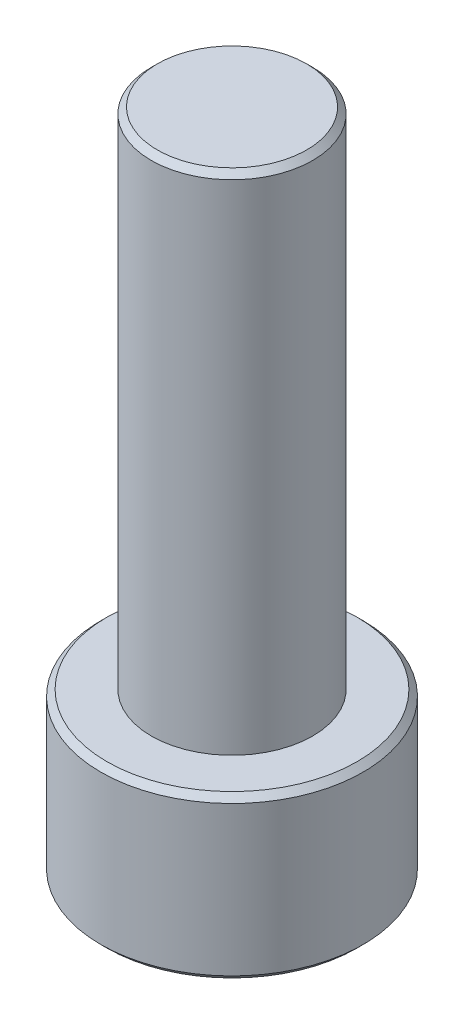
ISO-10303-21;
HEADER;
FILE_DESCRIPTION(('STEP AP214'),'2;1');
FILE_NAME('part.step','',(''),(''),'','','');
FILE_SCHEMA(('AUTOMOTIVE_DESIGN { 1 0 10303 214 1 1 1 1 }'));
ENDSEC;
DATA;
#1=APPLICATION_CONTEXT('core data for automotive mechanical design processes');
#2=APPLICATION_PROTOCOL_DEFINITION('international standard','automotive_design',2000,#1);
#3=PRODUCT_CONTEXT('',#1,'mechanical');
#4=PRODUCT('Part','Part','',(#3));
#5=PRODUCT_RELATED_PRODUCT_CATEGORY('part','',(#4));
#6=PRODUCT_DEFINITION_FORMATION('','',#4);
#7=PRODUCT_DEFINITION_CONTEXT('part definition',#1,'design');
#8=PRODUCT_DEFINITION('design','',#6,#7);
#9=PRODUCT_DEFINITION_SHAPE('','',#8);
#10=(LENGTH_UNIT() NAMED_UNIT(*) SI_UNIT(.MILLI.,.METRE.));
#11=(NAMED_UNIT(*) PLANE_ANGLE_UNIT() SI_UNIT($,.RADIAN.));
#12=(NAMED_UNIT(*) SI_UNIT($,.STERADIAN.) SOLID_ANGLE_UNIT());
#13=UNCERTAINTY_MEASURE_WITH_UNIT(LENGTH_MEASURE(1.E-05),#10,'distance_accuracy_value','');
#14=(GEOMETRIC_REPRESENTATION_CONTEXT(3) GLOBAL_UNCERTAINTY_ASSIGNED_CONTEXT((#13)) GLOBAL_UNIT_ASSIGNED_CONTEXT((#10,
#11,#12)) REPRESENTATION_CONTEXT('',''));
#15=CARTESIAN_POINT('',(0.,0.,0.));
#16=DIRECTION('',(0.,0.,1.));
#17=DIRECTION('',(1.,0.,0.));
#18=AXIS2_PLACEMENT_3D('',#15,#16,#17);
#19=CARTESIAN_POINT('',(0.,8.00000000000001,0.));
#20=DIRECTION('',(0.,1.,0.));
#21=DIRECTION('',(0.,0.,1.));
#22=AXIS2_PLACEMENT_3D('',#19,#20,#21);
#23=PLANE('',#22);
#24=CARTESIAN_POINT('',(0.,8.00000000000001,0.));
#25=DIRECTION('',(0.,1.,0.));
#26=DIRECTION('',(0.,0.,1.));
#27=AXIS2_PLACEMENT_3D('',#24,#25,#26);
#28=CIRCLE('',#27,6.2);
#29=CARTESIAN_POINT('',(0.,8.00000000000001,-6.2));
#30=VERTEX_POINT('',#29);
#31=EDGE_CURVE('E157',#30,#30,#28,.T.);
#32=ORIENTED_EDGE('',*,*,#31,.T.);
#33=EDGE_LOOP('',(#32));
#34=FACE_BOUND('',#33,.T.);
#35=CARTESIAN_POINT('',(0.,8.00000000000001,0.));
#36=DIRECTION('',(0.,1.,0.));
#37=DIRECTION('',(0.,0.,1.));
#38=AXIS2_PLACEMENT_3D('',#35,#36,#37);
#39=CIRCLE('',#38,4.);
#40=CARTESIAN_POINT('',(0.,8.00000000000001,-4.00000000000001));
#41=VERTEX_POINT('',#40);
#42=EDGE_CURVE('E140',#41,#41,#39,.T.);
#43=ORIENTED_EDGE('',*,*,#42,.F.);
#44=EDGE_LOOP('',(#43));
#45=FACE_BOUND('',#44,.T.);
#46=ADVANCED_FACE('F38',(#34,#45),#23,.T.);
#47=CARTESIAN_POINT('',(0.,8.00000000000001,0.));
#48=DIRECTION('',(0.,-1.,0.));
#49=DIRECTION('',(0.,0.,-1.));
#50=AXIS2_PLACEMENT_3D('',#47,#48,#49);
#51=CYLINDRICAL_SURFACE('',#50,6.5);
#52=CARTESIAN_POINT('',(0.,0.299999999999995,0.));
#53=DIRECTION('',(0.,1.,0.));
#54=DIRECTION('',(0.,0.,1.));
#55=AXIS2_PLACEMENT_3D('',#52,#53,#54);
#56=CIRCLE('',#55,6.5);
#57=CARTESIAN_POINT('',(0.,0.299999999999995,-6.5));
#58=VERTEX_POINT('',#57);
#59=EDGE_CURVE('E151',#58,#58,#56,.T.);
#60=CARTESIAN_POINT('',(0.,7.70000000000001,0.));
#61=DIRECTION('',(0.,1.,0.));
#62=DIRECTION('',(0.,0.,1.));
#63=AXIS2_PLACEMENT_3D('',#60,#61,#62);
#64=CIRCLE('',#63,6.5);
#65=CARTESIAN_POINT('',(0.,7.70000000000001,-6.5));
#66=VERTEX_POINT('',#65);
#67=EDGE_CURVE('E148',#66,#66,#64,.F.);
#68=CARTESIAN_POINT('',(0.,0.299999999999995,-6.5));
#69=CARTESIAN_POINT('',(0.,0.377083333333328,-6.5));
#70=CARTESIAN_POINT('',(0.,0.454166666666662,-6.5));
#71=CARTESIAN_POINT('',(0.,0.608333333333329,-6.5));
#72=CARTESIAN_POINT('',(0.,0.685416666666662,-6.5));
#73=CARTESIAN_POINT('',(0.,0.839583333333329,-6.5));
#74=CARTESIAN_POINT('',(0.,0.916666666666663,-6.5));
#75=CARTESIAN_POINT('',(0.,1.07083333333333,-6.5));
#76=CARTESIAN_POINT('',(0.,1.14791666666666,-6.5));
#77=CARTESIAN_POINT('',(0.,1.30208333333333,-6.5));
#78=CARTESIAN_POINT('',(0.,1.37916666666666,-6.5));
#79=CARTESIAN_POINT('',(0.,1.53333333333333,-6.5));
#80=CARTESIAN_POINT('',(0.,1.61041666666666,-6.5));
#81=CARTESIAN_POINT('',(0.,1.76458333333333,-6.5));
#82=CARTESIAN_POINT('',(0.,1.84166666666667,-6.5));
#83=CARTESIAN_POINT('',(0.,1.99583333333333,-6.5));
#84=CARTESIAN_POINT('',(0.,2.07291666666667,-6.5));
#85=CARTESIAN_POINT('',(0.,2.22708333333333,-6.5));
#86=CARTESIAN_POINT('',(0.,2.30416666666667,-6.5));
#87=CARTESIAN_POINT('',(0.,2.45833333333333,-6.5));
#88=CARTESIAN_POINT('',(0.,2.53541666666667,-6.5));
#89=CARTESIAN_POINT('',(0.,2.68958333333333,-6.5));
#90=CARTESIAN_POINT('',(0.,2.76666666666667,-6.5));
#91=CARTESIAN_POINT('',(0.,2.92083333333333,-6.5));
#92=CARTESIAN_POINT('',(0.,2.99791666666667,-6.5));
#93=CARTESIAN_POINT('',(0.,3.15208333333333,-6.5));
#94=CARTESIAN_POINT('',(0.,3.22916666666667,-6.5));
#95=CARTESIAN_POINT('',(0.,3.38333333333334,-6.5));
#96=CARTESIAN_POINT('',(0.,3.46041666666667,-6.5));
#97=CARTESIAN_POINT('',(0.,3.61458333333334,-6.5));
#98=CARTESIAN_POINT('',(0.,3.69166666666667,-6.5));
#99=CARTESIAN_POINT('',(0.,3.84583333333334,-6.5));
#100=CARTESIAN_POINT('',(0.,3.92291666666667,-6.5));
#101=CARTESIAN_POINT('',(0.,4.07708333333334,-6.5));
#102=CARTESIAN_POINT('',(0.,4.15416666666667,-6.5));
#103=CARTESIAN_POINT('',(0.,4.30833333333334,-6.5));
#104=CARTESIAN_POINT('',(0.,4.38541666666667,-6.5));
#105=CARTESIAN_POINT('',(0.,4.53958333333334,-6.5));
#106=CARTESIAN_POINT('',(0.,4.61666666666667,-6.5));
#107=CARTESIAN_POINT('',(0.,4.77083333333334,-6.5));
#108=CARTESIAN_POINT('',(0.,4.84791666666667,-6.5));
#109=CARTESIAN_POINT('',(0.,5.00208333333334,-6.5));
#110=CARTESIAN_POINT('',(0.,5.07916666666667,-6.5));
#111=CARTESIAN_POINT('',(0.,5.23333333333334,-6.5));
#112=CARTESIAN_POINT('',(0.,5.31041666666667,-6.5));
#113=CARTESIAN_POINT('',(0.,5.46458333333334,-6.5));
#114=CARTESIAN_POINT('',(0.,5.54166666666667,-6.5));
#115=CARTESIAN_POINT('',(0.,5.69583333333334,-6.5));
#116=CARTESIAN_POINT('',(0.,5.77291666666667,-6.5));
#117=CARTESIAN_POINT('',(0.,5.92708333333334,-6.5));
#118=CARTESIAN_POINT('',(0.,6.00416666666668,-6.5));
#119=CARTESIAN_POINT('',(0.,6.15833333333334,-6.5));
#120=CARTESIAN_POINT('',(0.,6.23541666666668,-6.5));
#121=CARTESIAN_POINT('',(0.,6.38958333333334,-6.5));
#122=CARTESIAN_POINT('',(0.,6.46666666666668,-6.5));
#123=CARTESIAN_POINT('',(0.,6.62083333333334,-6.5));
#124=CARTESIAN_POINT('',(0.,6.69791666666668,-6.5));
#125=CARTESIAN_POINT('',(0.,6.85208333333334,-6.5));
#126=CARTESIAN_POINT('',(0.,6.92916666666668,-6.5));
#127=CARTESIAN_POINT('',(0.,7.08333333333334,-6.5));
#128=CARTESIAN_POINT('',(0.,7.16041666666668,-6.5));
#129=CARTESIAN_POINT('',(0.,7.31458333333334,-6.5));
#130=CARTESIAN_POINT('',(0.,7.39166666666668,-6.5));
#131=CARTESIAN_POINT('',(0.,7.54583333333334,-6.5));
#132=CARTESIAN_POINT('',(0.,7.62291666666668,-6.5));
#133=CARTESIAN_POINT('',(0.,7.70000000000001,-6.5));
#134=B_SPLINE_CURVE_WITH_KNOTS('',3,(#68,#69,#70,#71,#72,#73,#74,#75,#76,#77,#78,#79,#80,#81,
#82,#83,#84,#85,#86,#87,#88,#89,#90,#91,#92,#93,#94,#95,#96,#97,#98,#99,#100,#101,#102,#103,
#104,#105,#106,#107,#108,#109,#110,#111,#112,#113,#114,#115,#116,#117,#118,#119,#120,#121,#122,
#123,#124,#125,#126,#127,#128,#129,#130,#131,#132,#133),.UNSPECIFIED.,.F.,.F.,(4,2,2,2,2,2,2,2,
2,2,2,2,2,2,2,2,2,2,2,2,2,2,2,2,2,2,2,2,2,2,2,2,4),(0.,0.231250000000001,0.462500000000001,
0.693750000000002,0.925000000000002,1.15625,1.3875,1.61875,1.85,2.08125,2.3125,2.54375000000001,
2.77500000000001,3.00625000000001,3.23750000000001,3.46875000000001,3.70000000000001,
3.93125000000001,4.16250000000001,4.39375000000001,4.62500000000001,4.85625000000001,
5.08750000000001,5.31875000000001,5.55000000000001,5.78125000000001,6.01250000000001,
6.24375000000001,6.47500000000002,6.70625000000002,6.93750000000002,7.16875000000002,
7.40000000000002),.UNSPECIFIED.);
#135=EDGE_CURVE('BSEAM178',#58,#66,#134,.T.);
#136=ORIENTED_EDGE('',*,*,#59,.T.);
#137=ORIENTED_EDGE('',*,*,#67,.T.);
#138=ORIENTED_EDGE('',*,*,#135,.T.);
#139=ORIENTED_EDGE('',*,*,#135,.F.);
#140=EDGE_LOOP('',(#136,#138,#137,#139));
#141=FACE_BOUND('',#140,.T.);
#142=ADVANCED_FACE('F178',(#141),#51,.T.);
#143=CARTESIAN_POINT('',(0.,0.,0.));
#144=DIRECTION('',(0.,1.,0.));
#145=DIRECTION('',(0.,0.,1.));
#146=AXIS2_PLACEMENT_3D('',#143,#144,#145);
#147=PLANE('',#146);
#148=DIRECTION('',(-0.5,0.,0.866025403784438));
#149=VECTOR('',#148,1.);
#150=CARTESIAN_POINT('',(3.52183664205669,0.,0.));
#151=LINE('',#150,#149);
#152=CARTESIAN_POINT('',(3.52183664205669,0.,0.));
#153=VERTEX_POINT('',#152);
#154=CARTESIAN_POINT('',(1.76091832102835,0.,3.05000000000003));
#155=VERTEX_POINT('',#154);
#156=EDGE_CURVE('E127',#153,#155,#151,.T.);
#157=ORIENTED_EDGE('',*,*,#156,.F.);
#158=DIRECTION('',(0.5,0.,0.866025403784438));
#159=VECTOR('',#158,1.);
#160=CARTESIAN_POINT('',(1.76091832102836,0.,-3.04999999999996));
#161=LINE('',#160,#159);
#162=CARTESIAN_POINT('',(1.76091832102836,0.,-3.04999999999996));
#163=VERTEX_POINT('',#162);
#164=EDGE_CURVE('E53',#163,#153,#161,.T.);
#165=ORIENTED_EDGE('',*,*,#164,.F.);
#166=DIRECTION('',(1.,0.,0.));
#167=VECTOR('',#166,1.);
#168=CARTESIAN_POINT('',(-1.76091832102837,0.,-3.04999999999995));
#169=LINE('',#168,#167);
#170=CARTESIAN_POINT('',(-1.76091832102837,0.,-3.04999999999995));
#171=VERTEX_POINT('',#170);
#172=EDGE_CURVE('E136',#171,#163,#169,.T.);
#173=ORIENTED_EDGE('',*,*,#172,.F.);
#174=DIRECTION('',(0.5,0.,-0.866025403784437));
#175=VECTOR('',#174,1.);
#176=CARTESIAN_POINT('',(-3.52183664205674,0.,0.));
#177=LINE('',#176,#175);
#178=CARTESIAN_POINT('',(-3.52183664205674,0.,0.));
#179=VERTEX_POINT('',#178);
#180=EDGE_CURVE('E134',#179,#171,#177,.T.);
#181=ORIENTED_EDGE('',*,*,#180,.F.);
#182=DIRECTION('',(-0.5,0.,-0.866025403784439));
#183=VECTOR('',#182,1.);
#184=CARTESIAN_POINT('',(-1.76091832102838,0.,3.05000000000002));
#185=LINE('',#184,#183);
#186=CARTESIAN_POINT('',(-1.76091832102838,0.,3.05000000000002));
#187=VERTEX_POINT('',#186);
#188=EDGE_CURVE('E101',#187,#179,#185,.T.);
#189=ORIENTED_EDGE('',*,*,#188,.F.);
#190=DIRECTION('',(-1.,0.,0.));
#191=VECTOR('',#190,1.);
#192=CARTESIAN_POINT('',(1.76091832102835,0.,3.05000000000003));
#193=LINE('',#192,#191);
#194=EDGE_CURVE('E130',#155,#187,#193,.T.);
#195=ORIENTED_EDGE('',*,*,#194,.F.);
#196=EDGE_LOOP('',(#157,#165,#173,#181,#189,#195));
#197=FACE_BOUND('',#196,.T.);
#198=CARTESIAN_POINT('',(0.,0.,0.));
#199=DIRECTION('',(0.,1.,0.));
#200=DIRECTION('',(0.,0.,1.));
#201=AXIS2_PLACEMENT_3D('',#198,#199,#200);
#202=CIRCLE('',#201,6.2);
#203=CARTESIAN_POINT('',(0.,0.,6.2));
#204=VERTEX_POINT('',#203);
#205=EDGE_CURVE('E154',#204,#204,#202,.F.);
#206=ORIENTED_EDGE('',*,*,#205,.T.);
#207=EDGE_LOOP('',(#206));
#208=FACE_BOUND('',#207,.T.);
#209=ADVANCED_FACE('F184',(#197,#208),#147,.F.);
#210=CARTESIAN_POINT('',(0.,33.,0.));
#211=DIRECTION('',(0.,-1.,0.));
#212=DIRECTION('',(0.,0.,-1.));
#213=AXIS2_PLACEMENT_3D('',#210,#211,#212);
#214=CYLINDRICAL_SURFACE('',#213,4.);
#215=CARTESIAN_POINT('',(0.,32.7,0.));
#216=DIRECTION('',(0.,1.,0.));
#217=DIRECTION('',(0.,0.,1.));
#218=AXIS2_PLACEMENT_3D('',#215,#216,#217);
#219=CIRCLE('',#218,4.);
#220=CARTESIAN_POINT('',(0.,32.7,-4.00000000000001));
#221=VERTEX_POINT('',#220);
#222=EDGE_CURVE('E11',#221,#221,#219,.F.);
#223=CARTESIAN_POINT('',(0.,32.7,-4.00000000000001));
#224=CARTESIAN_POINT('',(0.,32.4427083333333,-4.00000000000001));
#225=CARTESIAN_POINT('',(0.,32.1854166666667,-4.00000000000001));
#226=CARTESIAN_POINT('',(0.,31.6708333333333,-4.00000000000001));
#227=CARTESIAN_POINT('',(0.,31.4135416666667,-4.00000000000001));
#228=CARTESIAN_POINT('',(0.,30.8989583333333,-4.00000000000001));
#229=CARTESIAN_POINT('',(0.,30.6416666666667,-4.00000000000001));
#230=CARTESIAN_POINT('',(0.,30.1270833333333,-4.00000000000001));
#231=CARTESIAN_POINT('',(0.,29.8697916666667,-4.00000000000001));
#232=CARTESIAN_POINT('',(0.,29.3552083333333,-4.00000000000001));
#233=CARTESIAN_POINT('',(0.,29.0979166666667,-4.00000000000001));
#234=CARTESIAN_POINT('',(0.,28.5833333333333,-4.00000000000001));
#235=CARTESIAN_POINT('',(0.,28.3260416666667,-4.00000000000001));
#236=CARTESIAN_POINT('',(0.,27.8114583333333,-4.00000000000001));
#237=CARTESIAN_POINT('',(0.,27.5541666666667,-4.00000000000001));
#238=CARTESIAN_POINT('',(0.,27.0395833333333,-4.00000000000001));
#239=CARTESIAN_POINT('',(0.,26.7822916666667,-4.00000000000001));
#240=CARTESIAN_POINT('',(0.,26.2677083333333,-4.00000000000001));
#241=CARTESIAN_POINT('',(0.,26.0104166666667,-4.00000000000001));
#242=CARTESIAN_POINT('',(0.,25.4958333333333,-4.00000000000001));
#243=CARTESIAN_POINT('',(0.,25.2385416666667,-4.00000000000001));
#244=CARTESIAN_POINT('',(0.,24.7239583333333,-4.00000000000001));
#245=CARTESIAN_POINT('',(0.,24.4666666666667,-4.00000000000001));
#246=CARTESIAN_POINT('',(0.,23.9520833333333,-4.00000000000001));
#247=CARTESIAN_POINT('',(0.,23.6947916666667,-4.00000000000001));
#248=CARTESIAN_POINT('',(0.,23.1802083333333,-4.00000000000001));
#249=CARTESIAN_POINT('',(0.,22.9229166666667,-4.00000000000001));
#250=CARTESIAN_POINT('',(0.,22.4083333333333,-4.00000000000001));
#251=CARTESIAN_POINT('',(0.,22.1510416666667,-4.00000000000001));
#252=CARTESIAN_POINT('',(0.,21.6364583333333,-4.00000000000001));
#253=CARTESIAN_POINT('',(0.,21.3791666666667,-4.00000000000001));
#254=CARTESIAN_POINT('',(0.,20.8645833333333,-4.00000000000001));
#255=CARTESIAN_POINT('',(0.,20.6072916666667,-4.00000000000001));
#256=CARTESIAN_POINT('',(0.,20.0927083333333,-4.00000000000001));
#257=CARTESIAN_POINT('',(0.,19.8354166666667,-4.00000000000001));
#258=CARTESIAN_POINT('',(0.,19.3208333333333,-4.00000000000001));
#259=CARTESIAN_POINT('',(0.,19.0635416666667,-4.00000000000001));
#260=CARTESIAN_POINT('',(0.,18.5489583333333,-4.00000000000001));
#261=CARTESIAN_POINT('',(0.,18.2916666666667,-4.00000000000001));
#262=CARTESIAN_POINT('',(0.,17.7770833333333,-4.00000000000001));
#263=CARTESIAN_POINT('',(0.,17.5197916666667,-4.00000000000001));
#264=CARTESIAN_POINT('',(0.,17.0052083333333,-4.00000000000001));
#265=CARTESIAN_POINT('',(0.,16.7479166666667,-4.00000000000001));
#266=CARTESIAN_POINT('',(0.,16.2333333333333,-4.00000000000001));
#267=CARTESIAN_POINT('',(0.,15.9760416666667,-4.00000000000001));
#268=CARTESIAN_POINT('',(0.,15.4614583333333,-4.00000000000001));
#269=CARTESIAN_POINT('',(0.,15.2041666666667,-4.00000000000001));
#270=CARTESIAN_POINT('',(0.,14.6895833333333,-4.00000000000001));
#271=CARTESIAN_POINT('',(0.,14.4322916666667,-4.00000000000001));
#272=CARTESIAN_POINT('',(0.,13.9177083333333,-4.00000000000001));
#273=CARTESIAN_POINT('',(0.,13.6604166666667,-4.00000000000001));
#274=CARTESIAN_POINT('',(0.,13.1458333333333,-4.00000000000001));
#275=CARTESIAN_POINT('',(0.,12.8885416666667,-4.00000000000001));
#276=CARTESIAN_POINT('',(0.,12.3739583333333,-4.00000000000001));
#277=CARTESIAN_POINT('',(0.,12.1166666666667,-4.00000000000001));
#278=CARTESIAN_POINT('',(0.,11.6020833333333,-4.00000000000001));
#279=CARTESIAN_POINT('',(0.,11.3447916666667,-4.00000000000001));
#280=CARTESIAN_POINT('',(0.,10.8302083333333,-4.00000000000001));
#281=CARTESIAN_POINT('',(0.,10.5729166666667,-4.00000000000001));
#282=CARTESIAN_POINT('',(0.,10.0583333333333,-4.00000000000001));
#283=CARTESIAN_POINT('',(0.,9.80104166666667,-4.00000000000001));
#284=CARTESIAN_POINT('',(0.,9.28645833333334,-4.00000000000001));
#285=CARTESIAN_POINT('',(0.,9.02916666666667,-4.00000000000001));
#286=CARTESIAN_POINT('',(0.,8.51458333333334,-4.00000000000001));
#287=CARTESIAN_POINT('',(0.,8.25729166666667,-4.00000000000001));
#288=CARTESIAN_POINT('',(0.,8.00000000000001,-4.00000000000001));
#289=B_SPLINE_CURVE_WITH_KNOTS('',3,(#223,#224,#225,#226,#227,#228,#229,#230,#231,#232,#233,
#234,#235,#236,#237,#238,#239,#240,#241,#242,#243,#244,#245,#246,#247,#248,#249,#250,#251,#252,
#253,#254,#255,#256,#257,#258,#259,#260,#261,#262,#263,#264,#265,#266,#267,#268,#269,#270,#271,
#272,#273,#274,#275,#276,#277,#278,#279,#280,#281,#282,#283,#284,#285,#286,#287,#288),
.UNSPECIFIED.,.F.,.F.,(4,2,2,2,2,2,2,2,2,2,2,2,2,2,2,2,2,2,2,2,2,2,2,2,2,2,2,2,2,2,2,2,4),(0.,
0.771875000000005,1.54375,2.315625,3.0875,3.859375,4.63125,5.403125,6.175,6.946875,7.71875,
8.490625,9.2625,10.034375,10.80625,11.578125,12.35,13.121875,13.89375,14.665625,15.4375,
16.209375,16.98125,17.753125,18.525,19.296875,20.06875,20.840625,21.6125,22.384375,23.15625,
23.928125,24.7),.UNSPECIFIED.);
#290=EDGE_CURVE('BSEAM190',#221,#41,#289,.T.);
#291=ORIENTED_EDGE('',*,*,#222,.T.);
#292=ORIENTED_EDGE('',*,*,#42,.T.);
#293=ORIENTED_EDGE('',*,*,#290,.T.);
#294=ORIENTED_EDGE('',*,*,#290,.F.);
#295=EDGE_LOOP('',(#291,#293,#292,#294));
#296=FACE_BOUND('',#295,.T.);
#297=ADVANCED_FACE('F190',(#296),#214,.T.);
#298=CARTESIAN_POINT('',(0.,33.,0.));
#299=DIRECTION('',(0.,1.,0.));
#300=DIRECTION('',(0.,0.,1.));
#301=AXIS2_PLACEMENT_3D('',#298,#299,#300);
#302=PLANE('',#301);
#303=CARTESIAN_POINT('',(0.,33.,0.));
#304=DIRECTION('',(0.,1.,0.));
#305=DIRECTION('',(0.,0.,1.));
#306=AXIS2_PLACEMENT_3D('',#303,#304,#305);
#307=CIRCLE('',#306,3.7);
#308=CARTESIAN_POINT('',(0.,33.,-3.70000000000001));
#309=VERTEX_POINT('',#308);
#310=EDGE_CURVE('E46',#309,#309,#307,.T.);
#311=ORIENTED_EDGE('',*,*,#310,.T.);
#312=EDGE_LOOP('',(#311));
#313=FACE_BOUND('',#312,.T.);
#314=ADVANCED_FACE('F162',(#313),#302,.T.);
#315=CARTESIAN_POINT('',(0.,0.299999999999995,0.));
#316=DIRECTION('',(0.,1.,0.));
#317=DIRECTION('',(0.,0.,1.));
#318=AXIS2_PLACEMENT_3D('',#315,#316,#317);
#319=CONICAL_SURFACE('',#318,6.5,0.78539816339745);
#320=ORIENTED_EDGE('',*,*,#205,.F.);
#321=EDGE_LOOP('',(#320));
#322=FACE_BOUND('',#321,.T.);
#323=ORIENTED_EDGE('',*,*,#59,.F.);
#324=EDGE_LOOP('',(#323));
#325=FACE_BOUND('',#324,.T.);
#326=ADVANCED_FACE('F174',(#322,#325),#319,.T.);
#327=CARTESIAN_POINT('',(0.,8.00000000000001,0.));
#328=DIRECTION('',(0.,-1.,0.));
#329=DIRECTION('',(0.,0.,-1.));
#330=AXIS2_PLACEMENT_3D('',#327,#328,#329);
#331=CONICAL_SURFACE('',#330,6.2,0.785398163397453);
#332=CARTESIAN_POINT('',(0.,7.70000000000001,-6.5));
#333=CARTESIAN_POINT('',(0.,7.70312500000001,-6.496875));
#334=CARTESIAN_POINT('',(0.,7.70625000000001,-6.49375));
#335=CARTESIAN_POINT('',(0.,7.71250000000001,-6.4875));
#336=CARTESIAN_POINT('',(0.,7.71562500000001,-6.484375));
#337=CARTESIAN_POINT('',(0.,7.72187500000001,-6.478125));
#338=CARTESIAN_POINT('',(0.,7.72500000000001,-6.475));
#339=CARTESIAN_POINT('',(0.,7.73125000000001,-6.46875));
#340=CARTESIAN_POINT('',(0.,7.73437500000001,-6.465625));
#341=CARTESIAN_POINT('',(0.,7.74062500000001,-6.459375));
#342=CARTESIAN_POINT('',(0.,7.74375000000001,-6.45625));
#343=CARTESIAN_POINT('',(0.,7.75000000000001,-6.45));
#344=CARTESIAN_POINT('',(0.,7.75312500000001,-6.446875));
#345=CARTESIAN_POINT('',(0.,7.75937500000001,-6.440625));
#346=CARTESIAN_POINT('',(0.,7.76250000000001,-6.4375));
#347=CARTESIAN_POINT('',(0.,7.76875000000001,-6.43125));
#348=CARTESIAN_POINT('',(0.,7.77187500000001,-6.428125));
#349=CARTESIAN_POINT('',(0.,7.77812500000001,-6.421875));
#350=CARTESIAN_POINT('',(0.,7.78125000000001,-6.41875));
#351=CARTESIAN_POINT('',(0.,7.78750000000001,-6.4125));
#352=CARTESIAN_POINT('',(0.,7.79062500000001,-6.409375));
#353=CARTESIAN_POINT('',(0.,7.79687500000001,-6.403125));
#354=CARTESIAN_POINT('',(0.,7.80000000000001,-6.4));
#355=CARTESIAN_POINT('',(0.,7.80625000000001,-6.39375));
#356=CARTESIAN_POINT('',(0.,7.80937500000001,-6.390625));
#357=CARTESIAN_POINT('',(0.,7.81562500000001,-6.384375));
#358=CARTESIAN_POINT('',(0.,7.81875000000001,-6.38125));
#359=CARTESIAN_POINT('',(0.,7.82500000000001,-6.375));
#360=CARTESIAN_POINT('',(0.,7.82812500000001,-6.371875));
#361=CARTESIAN_POINT('',(0.,7.83437500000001,-6.365625));
#362=CARTESIAN_POINT('',(0.,7.83750000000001,-6.3625));
#363=CARTESIAN_POINT('',(0.,7.84375000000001,-6.35625));
#364=CARTESIAN_POINT('',(0.,7.84687500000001,-6.353125));
#365=CARTESIAN_POINT('',(0.,7.85312500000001,-6.346875));
#366=CARTESIAN_POINT('',(0.,7.85625000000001,-6.34375));
#367=CARTESIAN_POINT('',(0.,7.86250000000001,-6.3375));
#368=CARTESIAN_POINT('',(0.,7.86562500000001,-6.334375));
#369=CARTESIAN_POINT('',(0.,7.87187500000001,-6.328125));
#370=CARTESIAN_POINT('',(0.,7.87500000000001,-6.325));
#371=CARTESIAN_POINT('',(0.,7.88125000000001,-6.31875));
#372=CARTESIAN_POINT('',(0.,7.88437500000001,-6.315625));
#373=CARTESIAN_POINT('',(0.,7.89062500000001,-6.309375));
#374=CARTESIAN_POINT('',(0.,7.89375000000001,-6.30625));
#375=CARTESIAN_POINT('',(0.,7.90000000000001,-6.3));
#376=CARTESIAN_POINT('',(0.,7.90312500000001,-6.296875));
#377=CARTESIAN_POINT('',(0.,7.90937500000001,-6.290625));
#378=CARTESIAN_POINT('',(0.,7.91250000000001,-6.2875));
#379=CARTESIAN_POINT('',(0.,7.91875000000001,-6.28125));
#380=CARTESIAN_POINT('',(0.,7.92187500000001,-6.278125));
#381=CARTESIAN_POINT('',(0.,7.92812500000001,-6.271875));
#382=CARTESIAN_POINT('',(0.,7.93125000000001,-6.26875));
#383=CARTESIAN_POINT('',(0.,7.93750000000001,-6.2625));
#384=CARTESIAN_POINT('',(0.,7.94062500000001,-6.259375));
#385=CARTESIAN_POINT('',(0.,7.94687500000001,-6.253125));
#386=CARTESIAN_POINT('',(0.,7.95000000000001,-6.25));
#387=CARTESIAN_POINT('',(0.,7.95625000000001,-6.24375));
#388=CARTESIAN_POINT('',(0.,7.95937500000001,-6.240625));
#389=CARTESIAN_POINT('',(0.,7.96562500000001,-6.234375));
#390=CARTESIAN_POINT('',(0.,7.96875000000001,-6.23125));
#391=CARTESIAN_POINT('',(0.,7.97500000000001,-6.225));
#392=CARTESIAN_POINT('',(0.,7.97812500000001,-6.221875));
#393=CARTESIAN_POINT('',(0.,7.98437500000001,-6.215625));
#394=CARTESIAN_POINT('',(0.,7.98750000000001,-6.2125));
#395=CARTESIAN_POINT('',(0.,7.99375000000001,-6.20625));
#396=CARTESIAN_POINT('',(0.,7.99687500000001,-6.203125));
#397=CARTESIAN_POINT('',(0.,8.00000000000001,-6.2));
#398=B_SPLINE_CURVE_WITH_KNOTS('',3,(#332,#333,#334,#335,#336,#337,#338,#339,#340,#341,#342,
#343,#344,#345,#346,#347,#348,#349,#350,#351,#352,#353,#354,#355,#356,#357,#358,#359,#360,#361,
#362,#363,#364,#365,#366,#367,#368,#369,#370,#371,#372,#373,#374,#375,#376,#377,#378,#379,#380,
#381,#382,#383,#384,#385,#386,#387,#388,#389,#390,#391,#392,#393,#394,#395,#396,#397),
.UNSPECIFIED.,.F.,.F.,(4,2,2,2,2,2,2,2,2,2,2,2,2,2,2,2,2,2,2,2,2,2,2,2,2,2,2,2,2,2,2,2,4),(0.,
0.0132582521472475,0.0265165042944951,0.0397747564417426,0.0530330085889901,0.0662912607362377,
0.0795495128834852,0.0928077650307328,0.10606601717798,0.119324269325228,0.132582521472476,
0.145840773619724,0.15909902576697,0.172357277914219,0.185615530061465,0.198873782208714,
0.212132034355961,0.225390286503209,0.238648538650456,0.251906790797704,0.265165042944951,
0.278423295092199,0.291681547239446,0.304939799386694,0.318198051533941,0.33145630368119,
0.344714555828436,0.357972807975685,0.371231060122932,0.38448931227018,0.397747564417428,
0.411005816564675,0.424264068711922),.UNSPECIFIED.);
#399=EDGE_CURVE('BSEAM166',#66,#30,#398,.T.);
#400=ORIENTED_EDGE('',*,*,#67,.F.);
#401=ORIENTED_EDGE('',*,*,#31,.F.);
#402=ORIENTED_EDGE('',*,*,#399,.T.);
#403=ORIENTED_EDGE('',*,*,#399,.F.);
#404=EDGE_LOOP('',(#400,#402,#401,#403));
#405=FACE_BOUND('',#404,.T.);
#406=ADVANCED_FACE('F166',(#405),#331,.T.);
#407=CARTESIAN_POINT('',(0.,33.,0.));
#408=DIRECTION('',(0.,-1.,0.));
#409=DIRECTION('',(0.,0.,-1.));
#410=AXIS2_PLACEMENT_3D('',#407,#408,#409);
#411=CONICAL_SURFACE('',#410,3.7,0.785398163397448);
#412=CARTESIAN_POINT('',(0.,32.7,-4.));
#413=CARTESIAN_POINT('',(0.,32.703125,-3.996875));
#414=CARTESIAN_POINT('',(0.,32.70625,-3.99375));
#415=CARTESIAN_POINT('',(0.,32.7125,-3.9875));
#416=CARTESIAN_POINT('',(0.,32.715625,-3.984375));
#417=CARTESIAN_POINT('',(0.,32.721875,-3.978125));
#418=CARTESIAN_POINT('',(0.,32.725,-3.975));
#419=CARTESIAN_POINT('',(0.,32.73125,-3.96875));
#420=CARTESIAN_POINT('',(0.,32.734375,-3.965625));
#421=CARTESIAN_POINT('',(0.,32.740625,-3.959375));
#422=CARTESIAN_POINT('',(0.,32.74375,-3.95625));
#423=CARTESIAN_POINT('',(0.,32.75,-3.95));
#424=CARTESIAN_POINT('',(0.,32.753125,-3.946875));
#425=CARTESIAN_POINT('',(0.,32.759375,-3.940625));
#426=CARTESIAN_POINT('',(0.,32.7625,-3.9375));
#427=CARTESIAN_POINT('',(0.,32.76875,-3.93125));
#428=CARTESIAN_POINT('',(0.,32.771875,-3.928125));
#429=CARTESIAN_POINT('',(0.,32.778125,-3.92187500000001));
#430=CARTESIAN_POINT('',(0.,32.78125,-3.91875));
#431=CARTESIAN_POINT('',(0.,32.7875,-3.9125));
#432=CARTESIAN_POINT('',(0.,32.790625,-3.909375));
#433=CARTESIAN_POINT('',(0.,32.796875,-3.903125));
#434=CARTESIAN_POINT('',(0.,32.8,-3.9));
#435=CARTESIAN_POINT('',(0.,32.80625,-3.89375));
#436=CARTESIAN_POINT('',(0.,32.809375,-3.890625));
#437=CARTESIAN_POINT('',(0.,32.815625,-3.884375));
#438=CARTESIAN_POINT('',(0.,32.81875,-3.88125));
#439=CARTESIAN_POINT('',(0.,32.825,-3.875));
#440=CARTESIAN_POINT('',(0.,32.828125,-3.87187500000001));
#441=CARTESIAN_POINT('',(0.,32.834375,-3.865625));
#442=CARTESIAN_POINT('',(0.,32.8375,-3.8625));
#443=CARTESIAN_POINT('',(0.,32.84375,-3.85625));
#444=CARTESIAN_POINT('',(0.,32.846875,-3.85312500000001));
#445=CARTESIAN_POINT('',(0.,32.853125,-3.84687500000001));
#446=CARTESIAN_POINT('',(0.,32.85625,-3.84375000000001));
#447=CARTESIAN_POINT('',(0.,32.8625,-3.83750000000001));
#448=CARTESIAN_POINT('',(0.,32.865625,-3.83437500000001));
#449=CARTESIAN_POINT('',(0.,32.871875,-3.82812500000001));
#450=CARTESIAN_POINT('',(0.,32.875,-3.82500000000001));
#451=CARTESIAN_POINT('',(0.,32.88125,-3.81875000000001));
#452=CARTESIAN_POINT('',(0.,32.884375,-3.81562500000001));
#453=CARTESIAN_POINT('',(0.,32.890625,-3.80937500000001));
#454=CARTESIAN_POINT('',(0.,32.89375,-3.80625000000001));
#455=CARTESIAN_POINT('',(0.,32.9,-3.80000000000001));
#456=CARTESIAN_POINT('',(0.,32.903125,-3.79687500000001));
#457=CARTESIAN_POINT('',(0.,32.909375,-3.79062500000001));
#458=CARTESIAN_POINT('',(0.,32.9125,-3.78750000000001));
#459=CARTESIAN_POINT('',(0.,32.91875,-3.78125000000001));
#460=CARTESIAN_POINT('',(0.,32.921875,-3.77812500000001));
#461=CARTESIAN_POINT('',(0.,32.928125,-3.77187500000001));
#462=CARTESIAN_POINT('',(0.,32.93125,-3.76875000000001));
#463=CARTESIAN_POINT('',(0.,32.9375,-3.76250000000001));
#464=CARTESIAN_POINT('',(0.,32.940625,-3.75937500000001));
#465=CARTESIAN_POINT('',(0.,32.946875,-3.75312500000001));
#466=CARTESIAN_POINT('',(0.,32.95,-3.75000000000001));
#467=CARTESIAN_POINT('',(0.,32.95625,-3.74375000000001));
#468=CARTESIAN_POINT('',(0.,32.959375,-3.74062500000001));
#469=CARTESIAN_POINT('',(0.,32.965625,-3.73437500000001));
#470=CARTESIAN_POINT('',(0.,32.96875,-3.73125000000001));
#471=CARTESIAN_POINT('',(0.,32.975,-3.72500000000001));
#472=CARTESIAN_POINT('',(0.,32.978125,-3.72187500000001));
#473=CARTESIAN_POINT('',(0.,32.984375,-3.71562500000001));
#474=CARTESIAN_POINT('',(0.,32.9875,-3.71250000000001));
#475=CARTESIAN_POINT('',(0.,32.99375,-3.70625000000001));
#476=CARTESIAN_POINT('',(0.,32.996875,-3.70312500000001));
#477=CARTESIAN_POINT('',(0.,33.,-3.70000000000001));
#478=B_SPLINE_CURVE_WITH_KNOTS('',3,(#412,#413,#414,#415,#416,#417,#418,#419,#420,#421,#422,
#423,#424,#425,#426,#427,#428,#429,#430,#431,#432,#433,#434,#435,#436,#437,#438,#439,#440,#441,
#442,#443,#444,#445,#446,#447,#448,#449,#450,#451,#452,#453,#454,#455,#456,#457,#458,#459,#460,
#461,#462,#463,#464,#465,#466,#467,#468,#469,#470,#471,#472,#473,#474,#475,#476,#477),
.UNSPECIFIED.,.F.,.F.,(4,2,2,2,2,2,2,2,2,2,2,2,2,2,2,2,2,2,2,2,2,2,2,2,2,2,2,2,2,2,2,2,4),(0.,
0.0132582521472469,0.0265165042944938,0.0397747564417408,0.0530330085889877,0.0662912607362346,
0.0795495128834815,0.0928077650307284,0.10606601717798,0.119324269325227,0.132582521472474,
0.145840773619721,0.159099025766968,0.172357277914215,0.185615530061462,0.198873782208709,
0.212132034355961,0.225390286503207,0.238648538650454,0.251906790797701,0.265165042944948,
0.278423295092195,0.291681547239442,0.304939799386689,0.318198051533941,0.331456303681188,
0.344714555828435,0.357972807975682,0.371231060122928,0.384489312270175,0.397747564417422,
0.411005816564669,0.424264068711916),.UNSPECIFIED.);
#479=EDGE_CURVE('BSEAM40',#221,#309,#478,.T.);
#480=ORIENTED_EDGE('',*,*,#222,.F.);
#481=ORIENTED_EDGE('',*,*,#310,.F.);
#482=ORIENTED_EDGE('',*,*,#479,.T.);
#483=ORIENTED_EDGE('',*,*,#479,.F.);
#484=EDGE_LOOP('',(#480,#482,#481,#483));
#485=FACE_BOUND('',#484,.T.);
#486=ADVANCED_FACE('F40',(#485),#411,.T.);
#487=CARTESIAN_POINT('',(1.76091832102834,3.,-3.04999999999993));
#488=DIRECTION('',(0.866025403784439,0.,-0.5));
#489=DIRECTION('',(-0.5,0.,-0.866025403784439));
#490=AXIS2_PLACEMENT_3D('',#487,#488,#489);
#491=PLANE('',#490);
#492=ORIENTED_EDGE('',*,*,#164,.T.);
#493=DIRECTION('',(0.,-1.,0.));
#494=VECTOR('',#493,1.);
#495=CARTESIAN_POINT('',(3.52183664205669,3.,0.));
#496=LINE('',#495,#494);
#497=CARTESIAN_POINT('',(3.52183664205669,3.,0.));
#498=VERTEX_POINT('',#497);
#499=EDGE_CURVE('E83',#498,#153,#496,.T.);
#500=ORIENTED_EDGE('',*,*,#499,.F.);
#501=DIRECTION('',(0.5,0.,0.866025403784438));
#502=VECTOR('',#501,1.);
#503=CARTESIAN_POINT('',(1.76091832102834,3.,-3.04999999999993));
#504=LINE('',#503,#502);
#505=CARTESIAN_POINT('',(1.76091832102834,3.,-3.04999999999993));
#506=VERTEX_POINT('',#505);
#507=EDGE_CURVE('E138',#506,#498,#504,.T.);
#508=ORIENTED_EDGE('',*,*,#507,.F.);
#509=DIRECTION('',(0.,-1.,0.));
#510=VECTOR('',#509,1.);
#511=CARTESIAN_POINT('',(1.76091832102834,3.,-3.04999999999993));
#512=LINE('',#511,#510);
#513=EDGE_CURVE('E61',#506,#163,#512,.T.);
#514=ORIENTED_EDGE('',*,*,#513,.T.);
#515=EDGE_LOOP('',(#492,#500,#508,#514));
#516=FACE_BOUND('',#515,.T.);
#517=ADVANCED_FACE('F165',(#516),#491,.F.);
#518=CARTESIAN_POINT('',(-1.76091832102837,3.,-3.04999999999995));
#519=DIRECTION('',(0.,0.,-1.));
#520=DIRECTION('',(-1.,0.,0.));
#521=AXIS2_PLACEMENT_3D('',#518,#519,#520);
#522=PLANE('',#521);
#523=ORIENTED_EDGE('',*,*,#172,.T.);
#524=ORIENTED_EDGE('',*,*,#513,.F.);
#525=DIRECTION('',(1.,0.,0.));
#526=VECTOR('',#525,1.);
#527=CARTESIAN_POINT('',(-1.76091832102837,3.,-3.04999999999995));
#528=LINE('',#527,#526);
#529=CARTESIAN_POINT('',(-1.76091832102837,3.,-3.04999999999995));
#530=VERTEX_POINT('',#529);
#531=EDGE_CURVE('E113',#530,#506,#528,.T.);
#532=ORIENTED_EDGE('',*,*,#531,.F.);
#533=DIRECTION('',(0.,-1.,0.));
#534=VECTOR('',#533,1.);
#535=CARTESIAN_POINT('',(-1.76091832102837,3.,-3.04999999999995));
#536=LINE('',#535,#534);
#537=EDGE_CURVE('E105',#530,#171,#536,.T.);
#538=ORIENTED_EDGE('',*,*,#537,.T.);
#539=EDGE_LOOP('',(#523,#524,#532,#538));
#540=FACE_BOUND('',#539,.T.);
#541=ADVANCED_FACE('F172',(#540),#522,.F.);
#542=CARTESIAN_POINT('',(-3.52183664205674,3.,0.));
#543=DIRECTION('',(-0.866025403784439,0.,-0.5));
#544=DIRECTION('',(-0.5,0.,0.866025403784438));
#545=AXIS2_PLACEMENT_3D('',#542,#543,#544);
#546=PLANE('',#545);
#547=ORIENTED_EDGE('',*,*,#180,.T.);
#548=ORIENTED_EDGE('',*,*,#537,.F.);
#549=DIRECTION('',(0.5,0.,-0.866025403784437));
#550=VECTOR('',#549,1.);
#551=CARTESIAN_POINT('',(-3.52183664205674,3.,0.));
#552=LINE('',#551,#550);
#553=CARTESIAN_POINT('',(-3.52183664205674,3.,0.));
#554=VERTEX_POINT('',#553);
#555=EDGE_CURVE('E109',#554,#530,#552,.T.);
#556=ORIENTED_EDGE('',*,*,#555,.F.);
#557=DIRECTION('',(0.,-1.,0.));
#558=VECTOR('',#557,1.);
#559=CARTESIAN_POINT('',(-3.52183664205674,3.,0.));
#560=LINE('',#559,#558);
#561=EDGE_CURVE('E94',#554,#179,#560,.T.);
#562=ORIENTED_EDGE('',*,*,#561,.T.);
#563=EDGE_LOOP('',(#547,#548,#556,#562));
#564=FACE_BOUND('',#563,.T.);
#565=ADVANCED_FACE('F110',(#564),#546,.F.);
#566=CARTESIAN_POINT('',(-1.76091832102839,3.,3.05000000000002));
#567=DIRECTION('',(-0.866025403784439,0.,0.5));
#568=DIRECTION('',(0.5,0.,0.866025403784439));
#569=AXIS2_PLACEMENT_3D('',#566,#567,#568);
#570=PLANE('',#569);
#571=ORIENTED_EDGE('',*,*,#188,.T.);
#572=ORIENTED_EDGE('',*,*,#561,.F.);
#573=DIRECTION('',(-0.5,0.,-0.866025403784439));
#574=VECTOR('',#573,1.);
#575=CARTESIAN_POINT('',(-1.76091832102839,3.,3.05000000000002));
#576=LINE('',#575,#574);
#577=CARTESIAN_POINT('',(-1.76091832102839,3.,3.05000000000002));
#578=VERTEX_POINT('',#577);
#579=EDGE_CURVE('E98',#578,#554,#576,.T.);
#580=ORIENTED_EDGE('',*,*,#579,.F.);
#581=DIRECTION('',(0.,-1.,0.));
#582=VECTOR('',#581,1.);
#583=CARTESIAN_POINT('',(-1.76091832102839,3.,3.05000000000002));
#584=LINE('',#583,#582);
#585=EDGE_CURVE('E106',#578,#187,#584,.T.);
#586=ORIENTED_EDGE('',*,*,#585,.T.);
#587=EDGE_LOOP('',(#571,#572,#580,#586));
#588=FACE_BOUND('',#587,.T.);
#589=ADVANCED_FACE('F96',(#588),#570,.F.);
#590=CARTESIAN_POINT('',(1.76091832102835,3.,3.05000000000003));
#591=DIRECTION('',(0.,0.,1.));
#592=DIRECTION('',(1.,0.,0.));
#593=AXIS2_PLACEMENT_3D('',#590,#591,#592);
#594=PLANE('',#593);
#595=ORIENTED_EDGE('',*,*,#194,.T.);
#596=ORIENTED_EDGE('',*,*,#585,.F.);
#597=DIRECTION('',(-1.,0.,0.));
#598=VECTOR('',#597,1.);
#599=CARTESIAN_POINT('',(1.76091832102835,3.,3.05000000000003));
#600=LINE('',#599,#598);
#601=CARTESIAN_POINT('',(1.76091832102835,3.,3.05000000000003));
#602=VERTEX_POINT('',#601);
#603=EDGE_CURVE('E119',#602,#578,#600,.T.);
#604=ORIENTED_EDGE('',*,*,#603,.F.);
#605=DIRECTION('',(0.,-1.,0.));
#606=VECTOR('',#605,1.);
#607=CARTESIAN_POINT('',(1.76091832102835,3.,3.05000000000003));
#608=LINE('',#607,#606);
#609=EDGE_CURVE('E143',#602,#155,#608,.T.);
#610=ORIENTED_EDGE('',*,*,#609,.T.);
#611=EDGE_LOOP('',(#595,#596,#604,#610));
#612=FACE_BOUND('',#611,.T.);
#613=ADVANCED_FACE('F216',(#612),#594,.F.);
#614=CARTESIAN_POINT('',(3.52183664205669,3.,0.));
#615=DIRECTION('',(0.866025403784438,0.,0.5));
#616=DIRECTION('',(0.5,0.,-0.866025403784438));
#617=AXIS2_PLACEMENT_3D('',#614,#615,#616);
#618=PLANE('',#617);
#619=ORIENTED_EDGE('',*,*,#156,.T.);
#620=ORIENTED_EDGE('',*,*,#609,.F.);
#621=DIRECTION('',(-0.5,0.,0.866025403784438));
#622=VECTOR('',#621,1.);
#623=CARTESIAN_POINT('',(3.52183664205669,3.,0.));
#624=LINE('',#623,#622);
#625=EDGE_CURVE('E121',#498,#602,#624,.T.);
#626=ORIENTED_EDGE('',*,*,#625,.F.);
#627=ORIENTED_EDGE('',*,*,#499,.T.);
#628=EDGE_LOOP('',(#619,#620,#626,#627));
#629=FACE_BOUND('',#628,.T.);
#630=ADVANCED_FACE('F213',(#629),#618,.F.);
#631=CARTESIAN_POINT('',(3.52183664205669,3.,0.));
#632=DIRECTION('',(0.,-1.,0.));
#633=DIRECTION('',(0.,0.,-1.));
#634=AXIS2_PLACEMENT_3D('',#631,#632,#633);
#635=PLANE('',#634);
#636=ORIENTED_EDGE('',*,*,#507,.T.);
#637=ORIENTED_EDGE('',*,*,#625,.T.);
#638=ORIENTED_EDGE('',*,*,#603,.T.);
#639=ORIENTED_EDGE('',*,*,#579,.T.);
#640=ORIENTED_EDGE('',*,*,#555,.T.);
#641=ORIENTED_EDGE('',*,*,#531,.T.);
#642=EDGE_LOOP('',(#636,#637,#638,#639,#640,#641));
#643=FACE_BOUND('',#642,.T.);
#644=ADVANCED_FACE('F116',(#643),#635,.T.);
#645=CLOSED_SHELL('',(#46,#142,#209,#297,#314,#326,#406,#486,#517,#541,#565,#589,#613,#630,#644));
#646=MANIFOLD_SOLID_BREP('B2',#645);
#647=ADVANCED_BREP_SHAPE_REPRESENTATION('',(#18,#646),#14);
#648=SHAPE_DEFINITION_REPRESENTATION(#9,#647);
ENDSEC;
END-ISO-10303-21;
